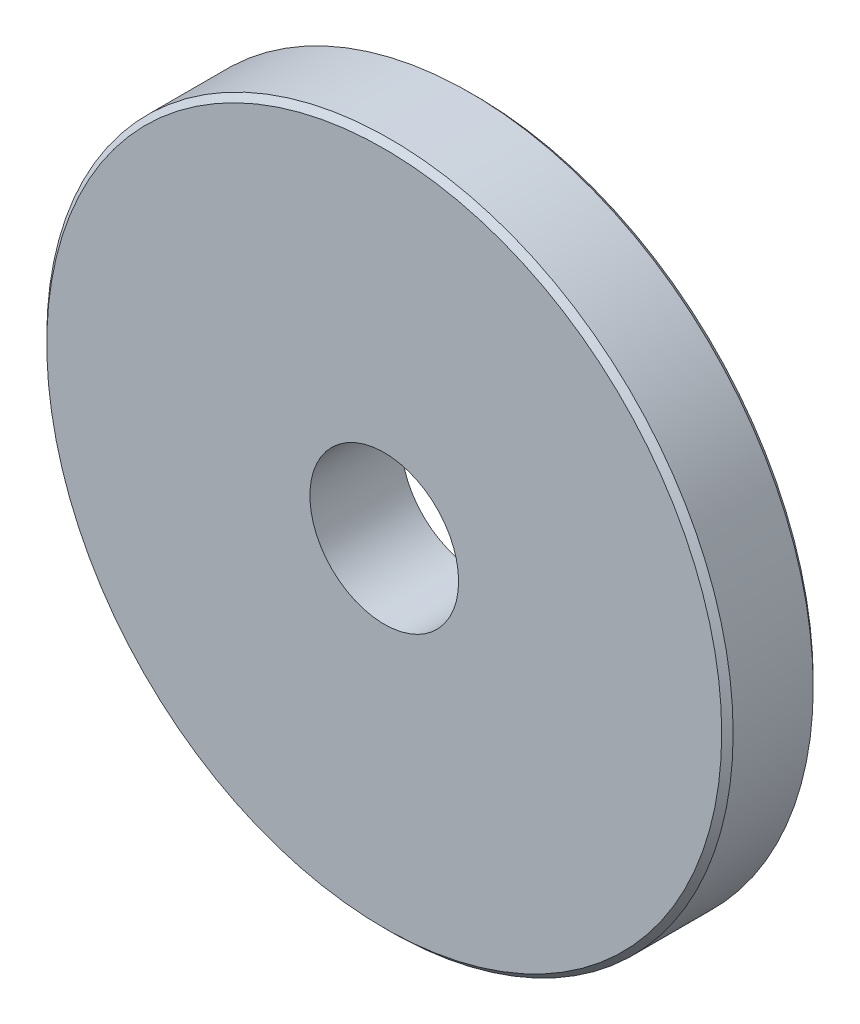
ISO-10303-21;
HEADER;
FILE_DESCRIPTION(('STEP AP214'),'2;1');
FILE_NAME('part.step','',(''),(''),'','','');
FILE_SCHEMA(('AUTOMOTIVE_DESIGN { 1 0 10303 214 1 1 1 1 }'));
ENDSEC;
DATA;
#1=APPLICATION_CONTEXT('core data for automotive mechanical design processes');
#2=APPLICATION_PROTOCOL_DEFINITION('international standard','automotive_design',2000,#1);
#3=PRODUCT_CONTEXT('',#1,'mechanical');
#4=PRODUCT('Part','Part','',(#3));
#5=PRODUCT_RELATED_PRODUCT_CATEGORY('part','',(#4));
#6=PRODUCT_DEFINITION_FORMATION('','',#4);
#7=PRODUCT_DEFINITION_CONTEXT('part definition',#1,'design');
#8=PRODUCT_DEFINITION('design','',#6,#7);
#9=PRODUCT_DEFINITION_SHAPE('','',#8);
#10=(LENGTH_UNIT() NAMED_UNIT(*) SI_UNIT(.MILLI.,.METRE.));
#11=(NAMED_UNIT(*) PLANE_ANGLE_UNIT() SI_UNIT($,.RADIAN.));
#12=(NAMED_UNIT(*) SI_UNIT($,.STERADIAN.) SOLID_ANGLE_UNIT());
#13=UNCERTAINTY_MEASURE_WITH_UNIT(LENGTH_MEASURE(1.E-05),#10,'distance_accuracy_value','');
#14=(GEOMETRIC_REPRESENTATION_CONTEXT(3) GLOBAL_UNCERTAINTY_ASSIGNED_CONTEXT((#13)) GLOBAL_UNIT_ASSIGNED_CONTEXT((#10,
#11,#12)) REPRESENTATION_CONTEXT('',''));
#15=CARTESIAN_POINT('',(0.,0.,0.));
#16=DIRECTION('',(0.,0.,1.));
#17=DIRECTION('',(1.,0.,0.));
#18=AXIS2_PLACEMENT_3D('',#15,#16,#17);
#19=CARTESIAN_POINT('',(0.,0.,8.));
#20=DIRECTION('',(0.,0.,1.));
#21=DIRECTION('',(1.,0.,0.));
#22=AXIS2_PLACEMENT_3D('',#19,#20,#21);
#23=PLANE('',#22);
#24=CARTESIAN_POINT('',(0.,0.,8.));
#25=DIRECTION('',(0.,0.,1.));
#26=DIRECTION('',(1.,0.,0.));
#27=AXIS2_PLACEMENT_3D('',#24,#25,#26);
#28=CIRCLE('',#27,29.5);
#29=CARTESIAN_POINT('',(29.5,0.,8.));
#30=VERTEX_POINT('',#29);
#31=EDGE_CURVE('E44',#30,#30,#28,.T.);
#32=ORIENTED_EDGE('',*,*,#31,.T.);
#33=EDGE_LOOP('',(#32));
#34=FACE_BOUND('',#33,.T.);
#35=CARTESIAN_POINT('',(0.,0.,8.));
#36=DIRECTION('',(0.,0.,1.));
#37=DIRECTION('',(1.,0.,0.));
#38=AXIS2_PLACEMENT_3D('',#35,#36,#37);
#39=CIRCLE('',#38,6.5);
#40=CARTESIAN_POINT('',(6.5,0.,8.));
#41=VERTEX_POINT('',#40);
#42=EDGE_CURVE('E49',#41,#41,#39,.T.);
#43=ORIENTED_EDGE('',*,*,#42,.F.);
#44=EDGE_LOOP('',(#43));
#45=FACE_BOUND('',#44,.T.);
#46=ADVANCED_FACE('F29',(#34,#45),#23,.T.);
#47=CARTESIAN_POINT('',(0.,0.,0.));
#48=DIRECTION('',(0.,0.,1.));
#49=DIRECTION('',(1.,0.,0.));
#50=AXIS2_PLACEMENT_3D('',#47,#48,#49);
#51=PLANE('',#50);
#52=CARTESIAN_POINT('',(0.,0.,0.));
#53=DIRECTION('',(0.,0.,1.));
#54=DIRECTION('',(1.,0.,0.));
#55=AXIS2_PLACEMENT_3D('',#52,#53,#54);
#56=CIRCLE('',#55,29.5);
#57=CARTESIAN_POINT('',(29.5,0.,0.));
#58=VERTEX_POINT('',#57);
#59=EDGE_CURVE('E10',#58,#58,#56,.F.);
#60=ORIENTED_EDGE('',*,*,#59,.T.);
#61=EDGE_LOOP('',(#60));
#62=FACE_BOUND('',#61,.T.);
#63=CARTESIAN_POINT('',(0.,0.,0.));
#64=DIRECTION('',(0.,0.,1.));
#65=DIRECTION('',(1.,0.,0.));
#66=AXIS2_PLACEMENT_3D('',#63,#64,#65);
#67=CIRCLE('',#66,6.5);
#68=CARTESIAN_POINT('',(6.5,0.,0.));
#69=VERTEX_POINT('',#68);
#70=EDGE_CURVE('E52',#69,#69,#67,.T.);
#71=ORIENTED_EDGE('',*,*,#70,.T.);
#72=EDGE_LOOP('',(#71));
#73=FACE_BOUND('',#72,.T.);
#74=ADVANCED_FACE('F56',(#62,#73),#51,.F.);
#75=CARTESIAN_POINT('',(0.,0.,8.));
#76=DIRECTION('',(0.,0.,-1.));
#77=DIRECTION('',(-1.,0.,0.));
#78=AXIS2_PLACEMENT_3D('',#75,#76,#77);
#79=CYLINDRICAL_SURFACE('',#78,30.);
#80=CARTESIAN_POINT('',(0.,0.,7.49999999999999));
#81=DIRECTION('',(0.,0.,1.));
#82=DIRECTION('',(1.,0.,0.));
#83=AXIS2_PLACEMENT_3D('',#80,#81,#82);
#84=CIRCLE('',#83,30.);
#85=CARTESIAN_POINT('',(30.,0.,7.49999999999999));
#86=VERTEX_POINT('',#85);
#87=EDGE_CURVE('E36',#86,#86,#84,.F.);
#88=ORIENTED_EDGE('',*,*,#87,.T.);
#89=EDGE_LOOP('',(#88));
#90=FACE_BOUND('',#89,.T.);
#91=CARTESIAN_POINT('',(0.,0.,0.499999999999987));
#92=DIRECTION('',(0.,0.,1.));
#93=DIRECTION('',(1.,0.,0.));
#94=AXIS2_PLACEMENT_3D('',#91,#92,#93);
#95=CIRCLE('',#94,30.);
#96=CARTESIAN_POINT('',(30.,0.,0.499999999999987));
#97=VERTEX_POINT('',#96);
#98=EDGE_CURVE('E40',#97,#97,#95,.T.);
#99=ORIENTED_EDGE('',*,*,#98,.T.);
#100=EDGE_LOOP('',(#99));
#101=FACE_BOUND('',#100,.T.);
#102=ADVANCED_FACE('F31',(#90,#101),#79,.T.);
#103=CARTESIAN_POINT('',(0.,0.,8.));
#104=DIRECTION('',(0.,0.,-1.));
#105=DIRECTION('',(-1.,0.,0.));
#106=AXIS2_PLACEMENT_3D('',#103,#104,#105);
#107=CYLINDRICAL_SURFACE('',#106,6.5);
#108=ORIENTED_EDGE('',*,*,#42,.T.);
#109=EDGE_LOOP('',(#108));
#110=FACE_BOUND('',#109,.T.);
#111=ORIENTED_EDGE('',*,*,#70,.F.);
#112=EDGE_LOOP('',(#111));
#113=FACE_BOUND('',#112,.T.);
#114=ADVANCED_FACE('F58',(#110,#113),#107,.F.);
#115=CARTESIAN_POINT('',(0.,0.,8.));
#116=DIRECTION('',(0.,0.,-1.));
#117=DIRECTION('',(-1.,0.,0.));
#118=AXIS2_PLACEMENT_3D('',#115,#116,#117);
#119=CONICAL_SURFACE('',#118,29.5,0.785398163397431);
#120=ORIENTED_EDGE('',*,*,#87,.F.);
#121=EDGE_LOOP('',(#120));
#122=FACE_BOUND('',#121,.T.);
#123=ORIENTED_EDGE('',*,*,#31,.F.);
#124=EDGE_LOOP('',(#123));
#125=FACE_BOUND('',#124,.T.);
#126=ADVANCED_FACE('F60',(#122,#125),#119,.T.);
#127=CARTESIAN_POINT('',(0.,0.,0.499999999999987));
#128=DIRECTION('',(0.,0.,1.));
#129=DIRECTION('',(1.,0.,0.));
#130=AXIS2_PLACEMENT_3D('',#127,#128,#129);
#131=CONICAL_SURFACE('',#130,30.,0.785398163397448);
#132=ORIENTED_EDGE('',*,*,#59,.F.);
#133=EDGE_LOOP('',(#132));
#134=FACE_BOUND('',#133,.T.);
#135=ORIENTED_EDGE('',*,*,#98,.F.);
#136=EDGE_LOOP('',(#135));
#137=FACE_BOUND('',#136,.T.);
#138=ADVANCED_FACE('F67',(#134,#137),#131,.T.);
#139=CLOSED_SHELL('',(#46,#74,#102,#114,#126,#138));
#140=MANIFOLD_SOLID_BREP('B2',#139);
#141=ADVANCED_BREP_SHAPE_REPRESENTATION('',(#18,#140),#14);
#142=SHAPE_DEFINITION_REPRESENTATION(#9,#141);
ENDSEC;
END-ISO-10303-21;
